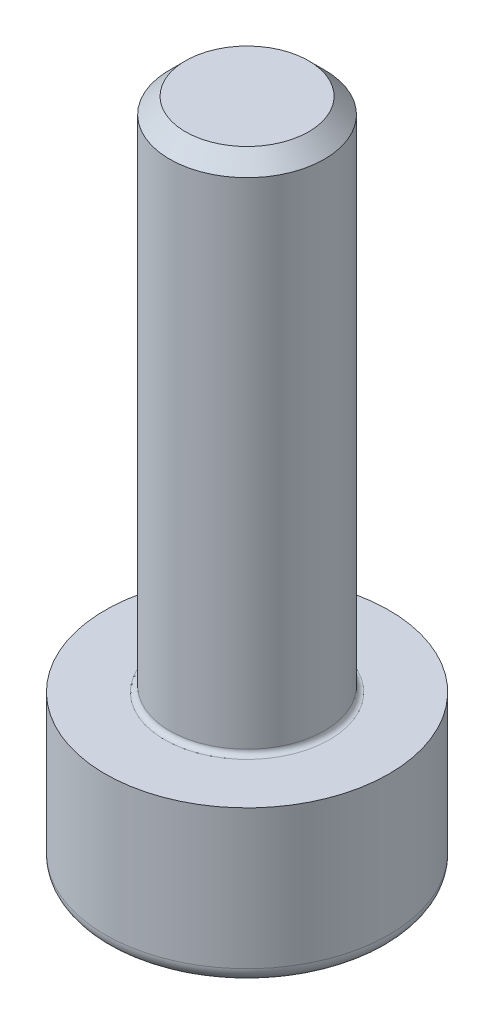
ISO-10303-21;
HEADER;
FILE_DESCRIPTION(('STEP AP214'),'2;1');
FILE_NAME('part.step','',(''),(''),'','','');
FILE_SCHEMA(('AUTOMOTIVE_DESIGN { 1 0 10303 214 1 1 1 1 }'));
ENDSEC;
DATA;
#1=APPLICATION_CONTEXT('core data for automotive mechanical design processes');
#2=APPLICATION_PROTOCOL_DEFINITION('international standard','automotive_design',2000,#1);
#3=PRODUCT_CONTEXT('',#1,'mechanical');
#4=PRODUCT('Part','Part','',(#3));
#5=PRODUCT_RELATED_PRODUCT_CATEGORY('part','',(#4));
#6=PRODUCT_DEFINITION_FORMATION('','',#4);
#7=PRODUCT_DEFINITION_CONTEXT('part definition',#1,'design');
#8=PRODUCT_DEFINITION('design','',#6,#7);
#9=PRODUCT_DEFINITION_SHAPE('','',#8);
#10=(LENGTH_UNIT() NAMED_UNIT(*) SI_UNIT(.MILLI.,.METRE.));
#11=(NAMED_UNIT(*) PLANE_ANGLE_UNIT() SI_UNIT($,.RADIAN.));
#12=(NAMED_UNIT(*) SI_UNIT($,.STERADIAN.) SOLID_ANGLE_UNIT());
#13=UNCERTAINTY_MEASURE_WITH_UNIT(LENGTH_MEASURE(1.E-05),#10,'distance_accuracy_value','');
#14=(GEOMETRIC_REPRESENTATION_CONTEXT(3) GLOBAL_UNCERTAINTY_ASSIGNED_CONTEXT((#13)) GLOBAL_UNIT_ASSIGNED_CONTEXT((#10,
#11,#12)) REPRESENTATION_CONTEXT('',''));
#15=CARTESIAN_POINT('',(0.,0.,0.));
#16=DIRECTION('',(0.,0.,1.));
#17=DIRECTION('',(1.,0.,0.));
#18=AXIS2_PLACEMENT_3D('',#15,#16,#17);
#19=CARTESIAN_POINT('',(0.,-3.,0.));
#20=DIRECTION('',(0.,-1.,0.));
#21=DIRECTION('',(1.,0.,0.));
#22=AXIS2_PLACEMENT_3D('',#19,#20,#21);
#23=PLANE('',#22);
#24=CARTESIAN_POINT('',(0.,-3.,0.));
#25=DIRECTION('',(0.,-1.,0.));
#26=DIRECTION('',(1.,0.,0.));
#27=AXIS2_PLACEMENT_3D('',#24,#25,#26);
#28=CIRCLE('',#27,2.45);
#29=CARTESIAN_POINT('',(2.45,-3.,0.));
#30=VERTEX_POINT('',#29);
#31=EDGE_CURVE('E27',#30,#30,#28,.T.);
#32=ORIENTED_EDGE('',*,*,#31,.T.);
#33=EDGE_LOOP('',(#32));
#34=FACE_BOUND('',#33,.T.);
#35=DIRECTION('',(-1.,0.,0.));
#36=VECTOR('',#35,1.);
#37=CARTESIAN_POINT('',(0.180421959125,-3.,-1.25));
#38=LINE('',#37,#36);
#39=CARTESIAN_POINT('',(0.7216878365,-3.,-1.25));
#40=VERTEX_POINT('',#39);
#41=CARTESIAN_POINT('',(-0.7216878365,-3.,-1.25));
#42=VERTEX_POINT('',#41);
#43=EDGE_CURVE('E133',#40,#42,#38,.T.);
#44=ORIENTED_EDGE('',*,*,#43,.T.);
#45=DIRECTION('',(-0.500000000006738,0.,0.866025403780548));
#46=VECTOR('',#45,1.);
#47=CARTESIAN_POINT('',(-1.08253175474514,-3.,-0.625000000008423));
#48=LINE('',#47,#46);
#49=CARTESIAN_POINT('',(-1.443375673,-3.,0.));
#50=VERTEX_POINT('',#49);
#51=EDGE_CURVE('E125',#42,#50,#48,.T.);
#52=ORIENTED_EDGE('',*,*,#51,.T.);
#53=DIRECTION('',(0.500000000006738,0.,0.866025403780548));
#54=VECTOR('',#53,1.);
#55=CARTESIAN_POINT('',(-1.08253175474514,-3.,0.625000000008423));
#56=LINE('',#55,#54);
#57=CARTESIAN_POINT('',(-0.7216878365,-3.,1.25));
#58=VERTEX_POINT('',#57);
#59=EDGE_CURVE('E123',#50,#58,#56,.T.);
#60=ORIENTED_EDGE('',*,*,#59,.T.);
#61=DIRECTION('',(1.,0.,0.));
#62=VECTOR('',#61,1.);
#63=CARTESIAN_POINT('',(0.,-3.,1.25));
#64=LINE('',#63,#62);
#65=CARTESIAN_POINT('',(0.7216878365,-3.,1.25));
#66=VERTEX_POINT('',#65);
#67=EDGE_CURVE('E103',#58,#66,#64,.T.);
#68=ORIENTED_EDGE('',*,*,#67,.T.);
#69=DIRECTION('',(0.500000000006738,0.,-0.866025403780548));
#70=VECTOR('',#69,1.);
#71=CARTESIAN_POINT('',(1.08253175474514,-3.,0.625000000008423));
#72=LINE('',#71,#70);
#73=CARTESIAN_POINT('',(1.443375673,-3.,0.));
#74=VERTEX_POINT('',#73);
#75=EDGE_CURVE('E114',#66,#74,#72,.T.);
#76=ORIENTED_EDGE('',*,*,#75,.T.);
#77=DIRECTION('',(-0.500000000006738,0.,-0.866025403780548));
#78=VECTOR('',#77,1.);
#79=CARTESIAN_POINT('',(1.08253175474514,-3.,-0.625000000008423));
#80=LINE('',#79,#78);
#81=EDGE_CURVE('E104',#74,#40,#80,.T.);
#82=ORIENTED_EDGE('',*,*,#81,.T.);
#83=EDGE_LOOP('',(#44,#52,#60,#68,#76,#82));
#84=FACE_BOUND('',#83,.T.);
#85=ADVANCED_FACE('F17',(#34,#84),#23,.T.);
#86=CARTESIAN_POINT('',(0.,0.,0.));
#87=DIRECTION('',(0.,1.,0.));
#88=DIRECTION('',(-1.,0.,0.));
#89=AXIS2_PLACEMENT_3D('',#86,#87,#88);
#90=PLANE('',#89);
#91=CARTESIAN_POINT('',(0.,0.,0.));
#92=DIRECTION('',(0.,1.,0.));
#93=DIRECTION('',(1.,0.,0.));
#94=AXIS2_PLACEMENT_3D('',#91,#92,#93);
#95=CIRCLE('',#94,2.75);
#96=CARTESIAN_POINT('',(2.75,0.,0.));
#97=VERTEX_POINT('',#96);
#98=EDGE_CURVE('E11',#97,#97,#95,.T.);
#99=ORIENTED_EDGE('',*,*,#98,.T.);
#100=EDGE_LOOP('',(#99));
#101=FACE_BOUND('',#100,.T.);
#102=CARTESIAN_POINT('',(0.,0.,0.));
#103=DIRECTION('',(0.,-1.,0.));
#104=DIRECTION('',(1.,0.,0.));
#105=AXIS2_PLACEMENT_3D('',#102,#103,#104);
#106=CIRCLE('',#105,1.6);
#107=CARTESIAN_POINT('',(1.6,0.,0.));
#108=VERTEX_POINT('',#107);
#109=EDGE_CURVE('E21',#108,#108,#106,.T.);
#110=ORIENTED_EDGE('',*,*,#109,.T.);
#111=EDGE_LOOP('',(#110));
#112=FACE_BOUND('',#111,.T.);
#113=ADVANCED_FACE('F84',(#101,#112),#90,.T.);
#114=CARTESIAN_POINT('',(0.,-1.5,0.));
#115=DIRECTION('',(0.,1.,0.));
#116=DIRECTION('',(1.,0.,0.));
#117=AXIS2_PLACEMENT_3D('',#114,#115,#116);
#118=CYLINDRICAL_SURFACE('',#117,2.75);
#119=ORIENTED_EDGE('',*,*,#98,.F.);
#120=EDGE_LOOP('',(#119));
#121=FACE_BOUND('',#120,.T.);
#122=CARTESIAN_POINT('',(0.,-2.7,0.));
#123=DIRECTION('',(0.,1.,0.));
#124=DIRECTION('',(1.,0.,0.));
#125=AXIS2_PLACEMENT_3D('',#122,#123,#124);
#126=CIRCLE('',#125,2.75);
#127=CARTESIAN_POINT('',(2.75,-2.7,0.));
#128=VERTEX_POINT('',#127);
#129=EDGE_CURVE('E129',#128,#128,#126,.T.);
#130=ORIENTED_EDGE('',*,*,#129,.T.);
#131=EDGE_LOOP('',(#130));
#132=FACE_BOUND('',#131,.T.);
#133=ADVANCED_FACE('F189',(#121,#132),#118,.T.);
#134=CARTESIAN_POINT('',(0.,-2.7,0.));
#135=DIRECTION('',(0.,-1.,0.));
#136=DIRECTION('',(0.,0.,-1.));
#137=AXIS2_PLACEMENT_3D('',#134,#135,#136);
#138=TOROIDAL_SURFACE('',#137,2.45,0.3);
#139=ORIENTED_EDGE('',*,*,#31,.F.);
#140=EDGE_LOOP('',(#139));
#141=FACE_BOUND('',#140,.T.);
#142=ORIENTED_EDGE('',*,*,#129,.F.);
#143=EDGE_LOOP('',(#142));
#144=FACE_BOUND('',#143,.T.);
#145=ADVANCED_FACE('F19',(#141,#144),#138,.T.);
#146=CARTESIAN_POINT('',(0.,-1.7,0.));
#147=DIRECTION('',(0.,1.,0.));
#148=DIRECTION('',(0.,0.,-1.));
#149=AXIS2_PLACEMENT_3D('',#146,#147,#148);
#150=PLANE('',#149);
#151=DIRECTION('',(1.,0.,0.));
#152=VECTOR('',#151,1.);
#153=CARTESIAN_POINT('',(0.,-1.7,-1.25));
#154=LINE('',#153,#152);
#155=CARTESIAN_POINT('',(-0.7216878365,-1.7,-1.25));
#156=VERTEX_POINT('',#155);
#157=CARTESIAN_POINT('',(0.7216878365,-1.7,-1.25));
#158=VERTEX_POINT('',#157);
#159=EDGE_CURVE('E86',#156,#158,#154,.T.);
#160=ORIENTED_EDGE('',*,*,#159,.T.);
#161=DIRECTION('',(0.500000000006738,0.,0.866025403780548));
#162=VECTOR('',#161,1.);
#163=CARTESIAN_POINT('',(1.443375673,-1.7,0.));
#164=LINE('',#163,#162);
#165=CARTESIAN_POINT('',(1.443375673,-1.7,0.));
#166=VERTEX_POINT('',#165);
#167=EDGE_CURVE('E107',#158,#166,#164,.T.);
#168=ORIENTED_EDGE('',*,*,#167,.T.);
#169=DIRECTION('',(-0.500000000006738,0.,0.866025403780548));
#170=VECTOR('',#169,1.);
#171=CARTESIAN_POINT('',(0.7216878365,-1.7,1.25));
#172=LINE('',#171,#170);
#173=CARTESIAN_POINT('',(0.7216878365,-1.7,1.25));
#174=VERTEX_POINT('',#173);
#175=EDGE_CURVE('E111',#166,#174,#172,.T.);
#176=ORIENTED_EDGE('',*,*,#175,.T.);
#177=DIRECTION('',(-1.,0.,0.));
#178=VECTOR('',#177,1.);
#179=CARTESIAN_POINT('',(-0.7216878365,-1.7,1.25));
#180=LINE('',#179,#178);
#181=CARTESIAN_POINT('',(-0.7216878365,-1.7,1.25));
#182=VERTEX_POINT('',#181);
#183=EDGE_CURVE('E100',#174,#182,#180,.T.);
#184=ORIENTED_EDGE('',*,*,#183,.T.);
#185=DIRECTION('',(-0.500000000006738,0.,-0.866025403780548));
#186=VECTOR('',#185,1.);
#187=CARTESIAN_POINT('',(-1.443375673,-1.7,0.));
#188=LINE('',#187,#186);
#189=CARTESIAN_POINT('',(-1.443375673,-1.7,0.));
#190=VERTEX_POINT('',#189);
#191=EDGE_CURVE('E118',#182,#190,#188,.T.);
#192=ORIENTED_EDGE('',*,*,#191,.T.);
#193=DIRECTION('',(0.500000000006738,0.,-0.866025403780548));
#194=VECTOR('',#193,1.);
#195=CARTESIAN_POINT('',(-0.7216878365,-1.7,-1.25));
#196=LINE('',#195,#194);
#197=EDGE_CURVE('E122',#190,#156,#196,.T.);
#198=ORIENTED_EDGE('',*,*,#197,.T.);
#199=EDGE_LOOP('',(#160,#168,#176,#184,#192,#198));
#200=FACE_BOUND('',#199,.T.);
#201=ADVANCED_FACE('F153',(#200),#150,.F.);
#202=CARTESIAN_POINT('',(-1.08253175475,-3.,-0.625));
#203=DIRECTION('',(-0.866025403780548,0.,-0.500000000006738));
#204=DIRECTION('',(-0.500000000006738,0.,0.866025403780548));
#205=AXIS2_PLACEMENT_3D('',#202,#203,#204);
#206=PLANE('',#205);
#207=ORIENTED_EDGE('',*,*,#197,.F.);
#208=DIRECTION('',(0.,1.,0.));
#209=VECTOR('',#208,1.);
#210=CARTESIAN_POINT('',(-1.443375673,-3.,0.));
#211=LINE('',#210,#209);
#212=EDGE_CURVE('E119',#50,#190,#211,.T.);
#213=ORIENTED_EDGE('',*,*,#212,.F.);
#214=ORIENTED_EDGE('',*,*,#51,.F.);
#215=DIRECTION('',(0.,1.,0.));
#216=VECTOR('',#215,1.);
#217=CARTESIAN_POINT('',(-0.7216878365,-3.,-1.25));
#218=LINE('',#217,#216);
#219=EDGE_CURVE('E89',#42,#156,#218,.T.);
#220=ORIENTED_EDGE('',*,*,#219,.T.);
#221=EDGE_LOOP('',(#207,#213,#214,#220));
#222=FACE_BOUND('',#221,.T.);
#223=ADVANCED_FACE('F156',(#222),#206,.F.);
#224=CARTESIAN_POINT('',(-1.08253175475,-3.,0.625));
#225=DIRECTION('',(-0.866025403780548,0.,0.500000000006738));
#226=DIRECTION('',(0.500000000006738,0.,0.866025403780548));
#227=AXIS2_PLACEMENT_3D('',#224,#225,#226);
#228=PLANE('',#227);
#229=ORIENTED_EDGE('',*,*,#191,.F.);
#230=DIRECTION('',(0.,1.,0.));
#231=VECTOR('',#230,1.);
#232=CARTESIAN_POINT('',(-0.7216878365,-3.,1.25));
#233=LINE('',#232,#231);
#234=EDGE_CURVE('E115',#58,#182,#233,.T.);
#235=ORIENTED_EDGE('',*,*,#234,.F.);
#236=ORIENTED_EDGE('',*,*,#59,.F.);
#237=ORIENTED_EDGE('',*,*,#212,.T.);
#238=EDGE_LOOP('',(#229,#235,#236,#237));
#239=FACE_BOUND('',#238,.T.);
#240=ADVANCED_FACE('F171',(#239),#228,.F.);
#241=CARTESIAN_POINT('',(0.,-3.,1.25));
#242=DIRECTION('',(0.,0.,1.));
#243=DIRECTION('',(1.,0.,0.));
#244=AXIS2_PLACEMENT_3D('',#241,#242,#243);
#245=PLANE('',#244);
#246=ORIENTED_EDGE('',*,*,#183,.F.);
#247=DIRECTION('',(0.,1.,0.));
#248=VECTOR('',#247,1.);
#249=CARTESIAN_POINT('',(0.7216878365,-3.,1.25));
#250=LINE('',#249,#248);
#251=EDGE_CURVE('E98',#66,#174,#250,.T.);
#252=ORIENTED_EDGE('',*,*,#251,.F.);
#253=ORIENTED_EDGE('',*,*,#67,.F.);
#254=ORIENTED_EDGE('',*,*,#234,.T.);
#255=EDGE_LOOP('',(#246,#252,#253,#254));
#256=FACE_BOUND('',#255,.T.);
#257=ADVANCED_FACE('F167',(#256),#245,.F.);
#258=CARTESIAN_POINT('',(1.08253175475,-3.,0.625));
#259=DIRECTION('',(0.866025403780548,0.,0.500000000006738));
#260=DIRECTION('',(0.500000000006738,0.,-0.866025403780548));
#261=AXIS2_PLACEMENT_3D('',#258,#259,#260);
#262=PLANE('',#261);
#263=ORIENTED_EDGE('',*,*,#175,.F.);
#264=DIRECTION('',(0.,1.,0.));
#265=VECTOR('',#264,1.);
#266=CARTESIAN_POINT('',(1.443375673,-3.,0.));
#267=LINE('',#266,#265);
#268=EDGE_CURVE('E106',#74,#166,#267,.T.);
#269=ORIENTED_EDGE('',*,*,#268,.F.);
#270=ORIENTED_EDGE('',*,*,#75,.F.);
#271=ORIENTED_EDGE('',*,*,#251,.T.);
#272=EDGE_LOOP('',(#263,#269,#270,#271));
#273=FACE_BOUND('',#272,.T.);
#274=ADVANCED_FACE('F163',(#273),#262,.F.);
#275=CARTESIAN_POINT('',(1.08253175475,-3.,-0.625));
#276=DIRECTION('',(0.866025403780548,0.,-0.500000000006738));
#277=DIRECTION('',(-0.500000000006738,0.,-0.866025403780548));
#278=AXIS2_PLACEMENT_3D('',#275,#276,#277);
#279=PLANE('',#278);
#280=ORIENTED_EDGE('',*,*,#167,.F.);
#281=DIRECTION('',(0.,1.,0.));
#282=VECTOR('',#281,1.);
#283=CARTESIAN_POINT('',(0.7216878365,-3.,-1.25));
#284=LINE('',#283,#282);
#285=EDGE_CURVE('E110',#40,#158,#284,.T.);
#286=ORIENTED_EDGE('',*,*,#285,.F.);
#287=ORIENTED_EDGE('',*,*,#81,.F.);
#288=ORIENTED_EDGE('',*,*,#268,.T.);
#289=EDGE_LOOP('',(#280,#286,#287,#288));
#290=FACE_BOUND('',#289,.T.);
#291=ADVANCED_FACE('F161',(#290),#279,.F.);
#292=CARTESIAN_POINT('',(0.36084391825,-3.,-1.25));
#293=DIRECTION('',(0.,0.,-1.));
#294=DIRECTION('',(-1.,0.,0.));
#295=AXIS2_PLACEMENT_3D('',#292,#293,#294);
#296=PLANE('',#295);
#297=ORIENTED_EDGE('',*,*,#159,.F.);
#298=ORIENTED_EDGE('',*,*,#219,.F.);
#299=ORIENTED_EDGE('',*,*,#43,.F.);
#300=ORIENTED_EDGE('',*,*,#285,.T.);
#301=EDGE_LOOP('',(#297,#298,#299,#300));
#302=FACE_BOUND('',#301,.T.);
#303=ADVANCED_FACE('F148',(#302),#296,.F.);
#304=CARTESIAN_POINT('',(0.,0.1,0.));
#305=DIRECTION('',(0.,1.,0.));
#306=DIRECTION('',(1.,0.,0.));
#307=AXIS2_PLACEMENT_3D('',#304,#305,#306);
#308=TOROIDAL_SURFACE('',#307,1.6,0.1);
#309=ORIENTED_EDGE('',*,*,#109,.F.);
#310=EDGE_LOOP('',(#309));
#311=FACE_BOUND('',#310,.T.);
#312=CARTESIAN_POINT('',(0.,0.1,0.));
#313=DIRECTION('',(0.,1.,0.));
#314=DIRECTION('',(0.,0.,1.));
#315=AXIS2_PLACEMENT_3D('',#312,#313,#314);
#316=CIRCLE('',#315,1.5);
#317=CARTESIAN_POINT('',(0.,0.1,-1.5));
#318=VERTEX_POINT('',#317);
#319=EDGE_CURVE('E87',#318,#318,#316,.T.);
#320=ORIENTED_EDGE('',*,*,#319,.F.);
#321=EDGE_LOOP('',(#320));
#322=FACE_BOUND('',#321,.T.);
#323=ADVANCED_FACE('F200',(#311,#322),#308,.F.);
#324=CARTESIAN_POINT('',(0.,10.,0.));
#325=DIRECTION('',(0.,1.,0.));
#326=DIRECTION('',(1.,0.,0.));
#327=AXIS2_PLACEMENT_3D('',#324,#325,#326);
#328=PLANE('',#327);
#329=CARTESIAN_POINT('',(0.,10.,0.));
#330=DIRECTION('',(0.,1.,0.));
#331=DIRECTION('',(1.,0.,0.));
#332=AXIS2_PLACEMENT_3D('',#329,#330,#331);
#333=CIRCLE('',#332,1.1933);
#334=CARTESIAN_POINT('',(1.1933,10.,0.));
#335=VERTEX_POINT('',#334);
#336=EDGE_CURVE('E95',#335,#335,#333,.T.);
#337=ORIENTED_EDGE('',*,*,#336,.T.);
#338=EDGE_LOOP('',(#337));
#339=FACE_BOUND('',#338,.T.);
#340=ADVANCED_FACE('F197',(#339),#328,.T.);
#341=CARTESIAN_POINT('',(0.,5.,0.));
#342=DIRECTION('',(0.,-1.,0.));
#343=DIRECTION('',(1.,0.,0.));
#344=AXIS2_PLACEMENT_3D('',#341,#342,#343);
#345=CYLINDRICAL_SURFACE('',#344,1.5);
#346=ORIENTED_EDGE('',*,*,#319,.T.);
#347=EDGE_LOOP('',(#346));
#348=FACE_BOUND('',#347,.T.);
#349=CARTESIAN_POINT('',(0.,9.6933,0.));
#350=DIRECTION('',(0.,-1.,0.));
#351=DIRECTION('',(1.,0.,0.));
#352=AXIS2_PLACEMENT_3D('',#349,#350,#351);
#353=CIRCLE('',#352,1.5);
#354=CARTESIAN_POINT('',(1.5,9.6933,0.));
#355=VERTEX_POINT('',#354);
#356=EDGE_CURVE('E91',#355,#355,#353,.T.);
#357=ORIENTED_EDGE('',*,*,#356,.T.);
#358=EDGE_LOOP('',(#357));
#359=FACE_BOUND('',#358,.T.);
#360=ADVANCED_FACE('F193',(#348,#359),#345,.T.);
#361=CARTESIAN_POINT('',(0.,9.84665,0.));
#362=DIRECTION('',(0.,-1.,0.));
#363=DIRECTION('',(1.,0.,0.));
#364=AXIS2_PLACEMENT_3D('',#361,#362,#363);
#365=CONICAL_SURFACE('',#364,1.34665,0.785398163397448);
#366=ORIENTED_EDGE('',*,*,#356,.F.);
#367=EDGE_LOOP('',(#366));
#368=FACE_BOUND('',#367,.T.);
#369=ORIENTED_EDGE('',*,*,#336,.F.);
#370=EDGE_LOOP('',(#369));
#371=FACE_BOUND('',#370,.T.);
#372=ADVANCED_FACE('F196',(#368,#371),#365,.T.);
#373=CLOSED_SHELL('',(#85,#113,#133,#145,#201,#223,#240,#257,#274,#291,#303,#323,#340,#360,#372));
#374=MANIFOLD_SOLID_BREP('B1',#373);
#375=ADVANCED_BREP_SHAPE_REPRESENTATION('',(#18,#374),#14);
#376=SHAPE_DEFINITION_REPRESENTATION(#9,#375);
ENDSEC;
END-ISO-10303-21;
